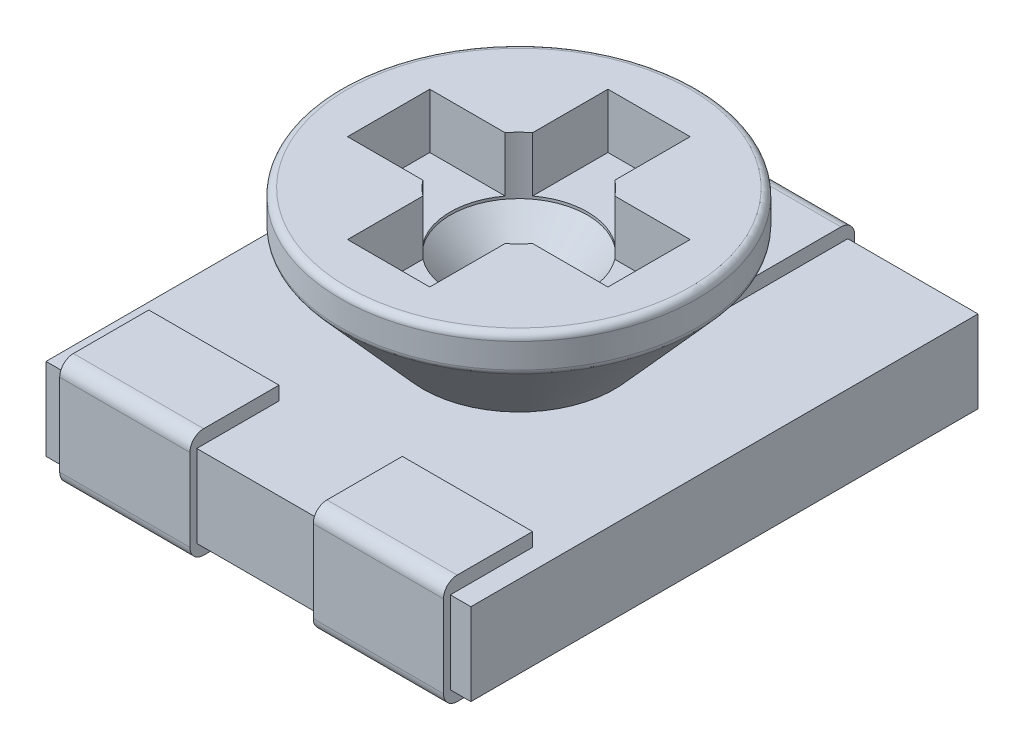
from build123d import *

# Parameters (mm, degrees)
EXTRUDE_START       = 0.1
SKETCH_1_W          = 3.1
SKETCH_1_H          = 3.7
EXTRUDE_1_DEPTH     = 0.6
SKETCH_2_W          = 1.2
SKETCH_2_H          = 0.95
SKETCH_2_W_2        = 0.95
SKETCH_2_H_2        = 0.65
EXTRUDE_2_DEPTH     = 0.8
FILLET_1_R          = 0.1
CUT_EXTRUDE_3_DEPTH = 0.4


with BuildPart() as part:
    # Sketch 1 → Extrude 1 (new body)
    with BuildSketch(Plane(origin=(0, 0, 0), x_dir=(1, 0, 0), z_dir=(0, 1, 0)).offset(EXTRUDE_START)):
        with Locations((0, -0.05)):
            Rectangle(SKETCH_1_W, SKETCH_1_H)
    extrude(amount=EXTRUDE_1_DEPTH)

    # Sketch 2 → Extrude 2 (add)
    with BuildSketch(Plane(origin=(0, 0, 0), x_dir=(1, 0, 0), z_dir=(0, 1, 0))):
        with Locations((0, 1.375)):
            Rectangle(SKETCH_2_W, SKETCH_2_H)
        with Locations((-0.925, -1.625)):
            Rectangle(SKETCH_2_W_2, SKETCH_2_H_2)
        with Locations((0.925, -1.625)):
            Rectangle(SKETCH_2_W_2, SKETCH_2_H_2)
    extrude(amount=EXTRUDE_2_DEPTH)

    # Fillet 1
    fillet_1_edges = [part.edges().sort_by_distance(p)[0] for p in [
        (0, 0, -1.85),
        (0, 0.8, -1.85),
        (-0.925, 0, 1.95),
        (-0.925, 0.8, 1.95),
        (0.925, 0, 1.95),
        (0.925, 0.8, 1.95),
    ]]
    fillet(fillet_1_edges, radius=FILLET_1_R)

    # Sketch 3 → Revolve 1 (revolve)
    with BuildSketch(Plane(origin=(0, 0, 0), x_dir=(0, 0, -1), z_dir=(1, 0, 0))):
        with BuildLine():
            Line((0.5, 1.62), (1.25, 1.62))
            ThreePointArc((1.25, 1.62), (1.285355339, 1.605355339), (1.3, 1.57))
            Line((1.3, 1.57), (1.3, 1.389115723))
            ThreePointArc((1.3, 1.389115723), (1.296703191, 1.371260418), (1.287247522, 1.355759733))
            Line((1.287247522, 1.355759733), (0.7, 0.7))
            Line((0.7, 0.7), (0.3, 0.7))
            Line((0.3, 0.7), (0.3, 1))
            Line((0.3, 1), (0.5, 1.2))
            Line((0.5, 1.2), (0.5, 1.62))
        make_face()
    revolve(axis=Axis((0, 0, 0), (0, 1, 0)))

    # Sketch 4 → Cut-Extrude 3 (cut)
    with BuildSketch(Plane(origin=(0, 1.62, 0), x_dir=(1, 0, 0), z_dir=(0, 1, 0))):
        Polygon((-0.95, 0.3), (-0.3, 0.3), (-0.3, 0.95), (0.3, 0.95), (0.3, 0.3), (0.95, 0.3), (0.95, -0.3), (0.3, -0.3), (0.3, -0.95), (-0.3, -0.95), (-0.3, -0.3), (-0.95, -0.3), align=None)
    extrude(amount=-CUT_EXTRUDE_3_DEPTH, mode=Mode.SUBTRACT)


solid = part.part
